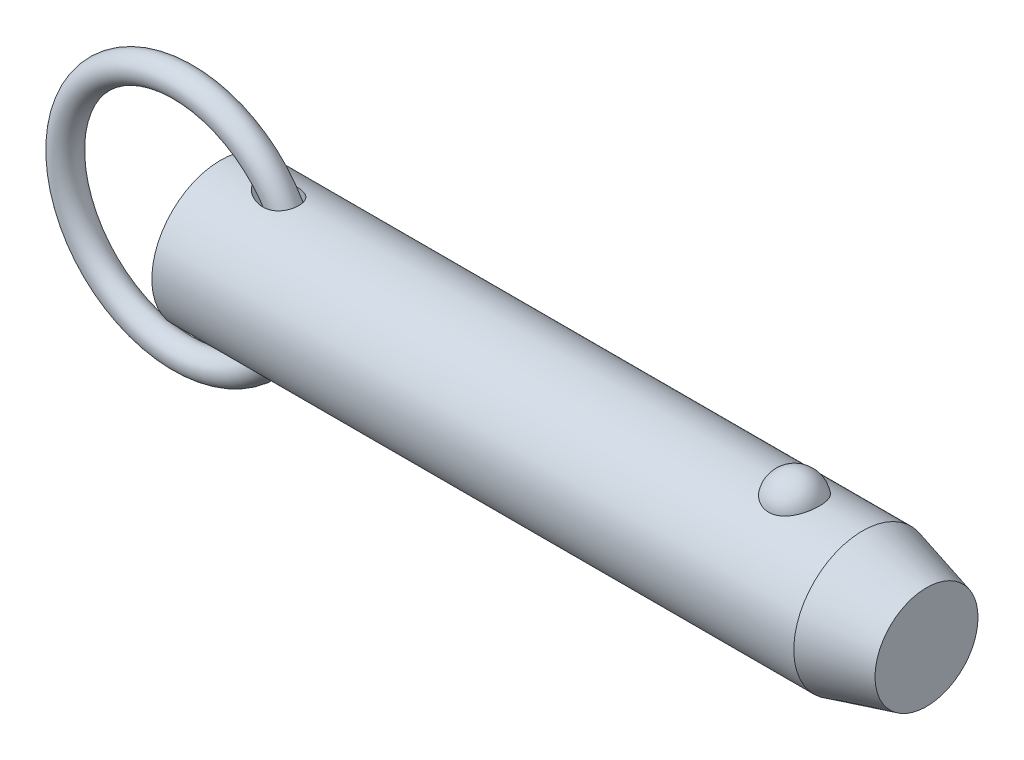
ISO-10303-21;
HEADER;
FILE_DESCRIPTION(('STEP AP214'),'2;1');
FILE_NAME('part.step','',(''),(''),'','','');
FILE_SCHEMA(('AUTOMOTIVE_DESIGN { 1 0 10303 214 1 1 1 1 }'));
ENDSEC;
DATA;
#1=APPLICATION_CONTEXT('core data for automotive mechanical design processes');
#2=APPLICATION_PROTOCOL_DEFINITION('international standard','automotive_design',2000,#1);
#3=PRODUCT_CONTEXT('',#1,'mechanical');
#4=PRODUCT('Part','Part','',(#3));
#5=PRODUCT_RELATED_PRODUCT_CATEGORY('part','',(#4));
#6=PRODUCT_DEFINITION_FORMATION('','',#4);
#7=PRODUCT_DEFINITION_CONTEXT('part definition',#1,'design');
#8=PRODUCT_DEFINITION('design','',#6,#7);
#9=PRODUCT_DEFINITION_SHAPE('','',#8);
#10=(LENGTH_UNIT() NAMED_UNIT(*) SI_UNIT(.MILLI.,.METRE.));
#11=(NAMED_UNIT(*) PLANE_ANGLE_UNIT() SI_UNIT($,.RADIAN.));
#12=(NAMED_UNIT(*) SI_UNIT($,.STERADIAN.) SOLID_ANGLE_UNIT());
#13=UNCERTAINTY_MEASURE_WITH_UNIT(LENGTH_MEASURE(1.E-05),#10,'distance_accuracy_value','');
#14=(GEOMETRIC_REPRESENTATION_CONTEXT(3) GLOBAL_UNCERTAINTY_ASSIGNED_CONTEXT((#13)) GLOBAL_UNIT_ASSIGNED_CONTEXT((#10,
#11,#12)) REPRESENTATION_CONTEXT('',''));
#15=CARTESIAN_POINT('',(0.,0.,0.));
#16=DIRECTION('',(0.,0.,1.));
#17=DIRECTION('',(1.,0.,0.));
#18=AXIS2_PLACEMENT_3D('',#15,#16,#17);
#19=CARTESIAN_POINT('',(-6.08699288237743,0.,0.));
#20=DIRECTION('',(0.,0.,1.));
#21=DIRECTION('',(1.,0.,0.));
#22=AXIS2_PLACEMENT_3D('',#19,#20,#21);
#23=TOROIDAL_SURFACE('',#22,19.05,2.223);
#24=CARTESIAN_POINT('',(15.1860071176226,0.,0.));
#25=VERTEX_POINT('',#24);
#26=VERTEX_LOOP('',#25);
#27=FACE_BOUND('',#26,.T.);
#28=ADVANCED_FACE('P0_F12',(#27),#23,.T.);
#29=CLOSED_SHELL('',(#28));
#30=MANIFOLD_SOLID_BREP('P0_B1',#29);
#31=CARTESIAN_POINT('',(0.,0.,0.));
#32=DIRECTION('',(1.,0.,0.));
#33=DIRECTION('',(0.,0.,-1.));
#34=AXIS2_PLACEMENT_3D('',#31,#32,#33);
#35=CYLINDRICAL_SURFACE('',#34,11.115);
#36=CARTESIAN_POINT('',(6.41405181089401,11.0227946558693,-1.4287136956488));
#37=CARTESIAN_POINT('',(6.49338916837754,11.0115377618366,-1.51556642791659));
#38=CARTESIAN_POINT('',(6.57765461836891,10.9998263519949,-1.59789397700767));
#39=CARTESIAN_POINT('',(6.75386647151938,10.9760304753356,-1.75391400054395));
#40=CARTESIAN_POINT('',(6.84582247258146,10.9639455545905,-1.82759540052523));
#41=CARTESIAN_POINT('',(7.03627827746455,10.9397989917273,-1.96698954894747));
#42=CARTESIAN_POINT('',(7.13480838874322,10.9277377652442,-2.03266078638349));
#43=CARTESIAN_POINT('',(7.33681032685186,10.9041015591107,-2.1558582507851));
#44=CARTESIAN_POINT('',(7.44028007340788,10.8925263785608,-2.21338786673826));
#45=CARTESIAN_POINT('',(7.64386117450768,10.8710104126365,-2.31666528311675));
#46=CARTESIAN_POINT('',(7.74368989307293,10.8610119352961,-2.36295942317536));
#47=CARTESIAN_POINT('',(7.94637195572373,10.8420168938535,-2.44863486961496));
#48=CARTESIAN_POINT('',(8.04922612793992,10.8330206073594,-2.48801426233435));
#49=CARTESIAN_POINT('',(8.36115573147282,10.807980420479,-2.59542730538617));
#50=CARTESIAN_POINT('',(8.57411849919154,10.7938278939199,-2.65299817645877));
#51=CARTESIAN_POINT('',(9.00825016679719,10.7725818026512,-2.73800108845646));
#52=CARTESIAN_POINT('',(9.22947335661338,10.7655491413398,-2.76517330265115));
#53=CARTESIAN_POINT('',(9.67368141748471,10.7605872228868,-2.78445308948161));
#54=CARTESIAN_POINT('',(9.89666486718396,10.7626512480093,-2.77658653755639));
#55=CARTESIAN_POINT('',(10.2950172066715,10.7754452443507,-2.72644436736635));
#56=CARTESIAN_POINT('',(10.4712789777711,10.7844280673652,-2.69109376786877));
#57=CARTESIAN_POINT('',(10.7292776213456,10.8024982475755,-2.61722365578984));
#58=CARTESIAN_POINT('',(10.8142337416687,10.8092901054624,-2.58911576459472));
#59=CARTESIAN_POINT('',(10.9813218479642,10.8242580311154,-2.52581287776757));
#60=CARTESIAN_POINT('',(11.0634550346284,10.8324335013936,-2.49062094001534));
#61=CARTESIAN_POINT('',(11.2247418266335,10.8500287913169,-2.41281958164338));
#62=CARTESIAN_POINT('',(11.3038694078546,10.8594572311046,-2.37015806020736));
#63=CARTESIAN_POINT('',(11.4576781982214,10.8792243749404,-2.27770403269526));
#64=CARTESIAN_POINT('',(11.5323615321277,10.8895626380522,-2.22791497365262));
#65=CARTESIAN_POINT('',(11.6765388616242,10.9108113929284,-2.12140590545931));
#66=CARTESIAN_POINT('',(11.7460329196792,10.9217218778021,-2.06468597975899));
#67=CARTESIAN_POINT('',(11.8790597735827,10.9437207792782,-1.94471764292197));
#68=CARTESIAN_POINT('',(11.9425932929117,10.9548091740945,-1.88147002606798));
#69=CARTESIAN_POINT('',(12.109388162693,10.9851999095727,-1.69784918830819));
#70=CARTESIAN_POINT('',(12.205655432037,11.0042655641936,-1.57093023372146));
#71=CARTESIAN_POINT('',(12.374151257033,11.0393391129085,-1.3017676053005));
#72=CARTESIAN_POINT('',(12.4463875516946,11.0553479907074,-1.15952888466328));
#73=CARTESIAN_POINT('',(12.5615818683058,11.0816338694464,-0.871972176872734));
#74=CARTESIAN_POINT('',(12.6058896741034,11.0921698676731,-0.727217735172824));
#75=CARTESIAN_POINT('',(12.6699315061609,11.1075802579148,-0.432089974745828));
#76=CARTESIAN_POINT('',(12.6896681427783,11.1124552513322,-0.281717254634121));
#77=CARTESIAN_POINT('',(12.7040225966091,11.1159901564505,0.0188164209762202));
#78=CARTESIAN_POINT('',(12.6988836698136,11.1147102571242,0.168965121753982));
#79=CARTESIAN_POINT('',(12.6641681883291,11.1062126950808,0.466238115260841));
#80=CARTESIAN_POINT('',(12.6345920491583,11.0989951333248,0.61336245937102));
#81=CARTESIAN_POINT('',(12.5517453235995,11.0794095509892,0.900330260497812));
#82=CARTESIAN_POINT('',(12.4984878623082,11.0670443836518,1.0401777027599));
#83=CARTESIAN_POINT('',(12.3696588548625,11.0385082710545,1.308745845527));
#84=CARTESIAN_POINT('',(12.2940887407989,11.0223375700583,1.43746725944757));
#85=CARTESIAN_POINT('',(12.122380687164,10.987872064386,1.68079704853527));
#86=CARTESIAN_POINT('',(12.0261637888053,10.969569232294,1.79534850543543));
#87=CARTESIAN_POINT('',(11.8161707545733,10.932836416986,2.00695695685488));
#88=CARTESIAN_POINT('',(11.7023941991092,10.9144064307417,2.10401353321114));
#89=CARTESIAN_POINT('',(11.4575656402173,10.8788057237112,2.28105326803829));
#90=CARTESIAN_POINT('',(11.3261451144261,10.8616794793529,2.36053412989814));
#91=CARTESIAN_POINT('',(11.0523589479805,10.8308019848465,2.49839044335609));
#92=CARTESIAN_POINT('',(10.9099908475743,10.8170514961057,2.55676113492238));
#93=CARTESIAN_POINT('',(10.6060622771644,10.7929728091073,2.65666105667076));
#94=CARTESIAN_POINT('',(10.4438877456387,10.7830209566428,2.69640163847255));
#95=CARTESIAN_POINT('',(10.1154037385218,10.7687230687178,2.75293129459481));
#96=CARTESIAN_POINT('',(9.94909141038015,10.7643810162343,2.76970406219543));
#97=CARTESIAN_POINT('',(9.54387061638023,10.7604809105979,2.7848723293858));
#98=CARTESIAN_POINT('',(9.30446860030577,10.7637793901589,2.77227753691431));
#99=CARTESIAN_POINT('',(8.9496125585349,10.7757341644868,2.72524141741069));
#100=CARTESIAN_POINT('',(8.83186896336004,10.7808994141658,2.70482239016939));
#101=CARTESIAN_POINT('',(8.59835142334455,10.7932548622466,2.6550999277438));
#102=CARTESIAN_POINT('',(8.48257728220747,10.8004448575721,2.62579738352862));
#103=CARTESIAN_POINT('',(8.25208469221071,10.8166382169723,2.55827624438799));
#104=CARTESIAN_POINT('',(8.13740214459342,10.8256649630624,2.51994155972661));
#105=CARTESIAN_POINT('',(7.91132058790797,10.8451170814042,2.43486475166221));
#106=CARTESIAN_POINT('',(7.79992154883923,10.8555424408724,2.38812270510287));
#107=CARTESIAN_POINT('',(7.58115677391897,10.8774251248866,2.28638483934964));
#108=CARTESIAN_POINT('',(7.47378802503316,10.8888816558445,2.23139534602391));
#109=CARTESIAN_POINT('',(7.26385624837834,10.9124540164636,2.1131026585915));
#110=CARTESIAN_POINT('',(7.16129168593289,10.9245696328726,2.04980214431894));
#111=CARTESIAN_POINT('',(6.91882218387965,10.9543689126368,1.88540538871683));
#112=CARTESIAN_POINT('',(6.78193778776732,10.9721958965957,1.77979827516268));
#113=CARTESIAN_POINT('',(6.5247244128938,11.0070222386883,1.54989693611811));
#114=CARTESIAN_POINT('',(6.40436902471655,11.0240228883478,1.42563320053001));
#115=CARTESIAN_POINT('',(6.21838804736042,11.0509658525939,1.19529359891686));
#116=CARTESIAN_POINT('',(6.14691885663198,11.0615430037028,1.09404520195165));
#117=CARTESIAN_POINT('',(6.02043496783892,11.0805004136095,0.881508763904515));
#118=CARTESIAN_POINT('',(5.96539400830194,11.0888841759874,0.770237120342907));
#119=CARTESIAN_POINT('',(5.88475453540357,11.1012553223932,0.560577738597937));
#120=CARTESIAN_POINT('',(5.85559643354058,11.1057686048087,0.463603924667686));
#121=CARTESIAN_POINT('',(5.81381299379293,11.1122523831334,0.266083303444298));
#122=CARTESIAN_POINT('',(5.80117118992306,11.1142254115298,0.165540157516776));
#123=CARTESIAN_POINT('',(5.79363815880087,11.1153999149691,-0.036474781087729));
#124=CARTESIAN_POINT('',(5.79878799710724,11.1145949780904,-0.137948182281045));
#125=CARTESIAN_POINT('',(5.82639592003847,11.1102987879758,-0.338493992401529));
#126=CARTESIAN_POINT('',(5.84887234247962,11.1068046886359,-0.43756374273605));
#127=CARTESIAN_POINT('',(5.91510741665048,11.0965857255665,-0.649968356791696));
#128=CARTESIAN_POINT('',(5.9622090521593,11.0893566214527,-0.762222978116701));
#129=CARTESIAN_POINT('',(6.07378449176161,11.072471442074,-0.977396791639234));
#130=CARTESIAN_POINT('',(6.13826787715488,11.0628140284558,-1.08031079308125));
#131=CARTESIAN_POINT('',(6.2410107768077,11.0477136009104,-1.2219580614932));
#132=CARTESIAN_POINT('',(6.27403486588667,11.042895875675,-1.26469183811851));
#133=CARTESIAN_POINT('',(6.34238022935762,11.0330152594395,-1.34817011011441));
#134=CARTESIAN_POINT('',(6.37769867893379,11.0279526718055,-1.38891694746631));
#135=CARTESIAN_POINT('',(6.41405181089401,11.0227946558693,-1.4287136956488));
#136=B_SPLINE_CURVE_WITH_KNOTS('',3,(#36,#37,#38,#39,#40,#41,#42,#43,#44,#45,#46,#47,#48,#49,
#50,#51,#52,#53,#54,#55,#56,#57,#58,#59,#60,#61,#62,#63,#64,#65,#66,#67,#68,#69,#70,#71,#72,#73,
#74,#75,#76,#77,#78,#79,#80,#81,#82,#83,#84,#85,#86,#87,#88,#89,#90,#91,#92,#93,#94,#95,#96,#97,
#98,#99,#100,#101,#102,#103,#104,#105,#106,#107,#108,#109,#110,#111,#112,#113,#114,#115,#116,
#117,#118,#119,#120,#121,#122,#123,#124,#125,#126,#127,#128,#129,#130,#131,#132,#133,#134,#135),
.UNSPECIFIED.,.T.,.F.,(4,2,2,2,2,2,2,2,2,2,2,2,2,2,2,2,2,2,2,2,2,2,2,2,2,2,2,2,2,2,2,2,2,2,2,2,
2,2,2,2,2,2,2,2,2,2,2,2,2,4),(0.,0.35443329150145,0.709315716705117,1.0659654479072,
1.42246628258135,1.7536715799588,2.08496839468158,2.74582009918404,3.41227815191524,
4.07824412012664,4.61583787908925,4.88478112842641,5.1536085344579,5.42439170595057,
5.69504436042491,5.96569375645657,6.23631025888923,6.71490729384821,7.19335005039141,
7.64641437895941,8.09943057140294,8.54802575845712,8.99661331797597,9.44495256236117,
9.89326303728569,10.3433195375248,10.7933867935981,11.2550086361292,11.7167345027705,
12.2165866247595,12.7167934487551,13.4318876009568,13.7904664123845,14.1490092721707,
14.5124394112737,14.8758662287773,15.239015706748,15.6020483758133,16.1219860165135,
16.6410830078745,17.0130520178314,17.3844231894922,17.6872330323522,17.9897407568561,
18.2929471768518,18.5964749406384,18.9603532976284,19.3244326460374,19.4870338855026,
19.649438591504),.UNSPECIFIED.);
#137=CARTESIAN_POINT('',(6.41405181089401,11.0227946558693,-1.4287136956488));
#138=VERTEX_POINT('',#137);
#139=EDGE_CURVE('P1_E40',#138,#138,#136,.T.);
#140=ORIENTED_EDGE('',*,*,#139,.T.);
#141=EDGE_LOOP('',(#140));
#142=FACE_BOUND('',#141,.T.);
#143=CARTESIAN_POINT('',(103.929563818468,0.,0.));
#144=DIRECTION('',(1.,0.,0.));
#145=DIRECTION('',(0.,0.,-1.));
#146=AXIS2_PLACEMENT_3D('',#143,#144,#145);
#147=CIRCLE('',#146,11.115);
#148=CARTESIAN_POINT('',(103.929563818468,0.,-11.115));
#149=VERTEX_POINT('',#148);
#150=EDGE_CURVE('P1_E25',#149,#149,#147,.T.);
#151=ORIENTED_EDGE('',*,*,#150,.F.);
#152=EDGE_LOOP('',(#151));
#153=FACE_BOUND('',#152,.T.);
#154=CARTESIAN_POINT('',(0.,0.,0.));
#155=DIRECTION('',(1.,0.,0.));
#156=DIRECTION('',(0.,0.,-1.));
#157=AXIS2_PLACEMENT_3D('',#154,#155,#156);
#158=CIRCLE('',#157,11.115);
#159=CARTESIAN_POINT('',(0.,0.,-11.115));
#160=VERTEX_POINT('',#159);
#161=EDGE_CURVE('P1_E9',#160,#160,#158,.T.);
#162=ORIENTED_EDGE('',*,*,#161,.T.);
#163=EDGE_LOOP('',(#162));
#164=FACE_BOUND('',#163,.T.);
#165=CARTESIAN_POINT('',(92.9310680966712,10.3028087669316,4.17077409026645));
#166=CARTESIAN_POINT('',(92.7147756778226,10.3028003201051,4.17078240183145));
#167=CARTESIAN_POINT('',(92.4985488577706,10.3098895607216,4.15340593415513));
#168=CARTESIAN_POINT('',(92.0725408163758,10.3373834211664,4.08449540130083));
#169=CARTESIAN_POINT('',(91.8627577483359,10.3577841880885,4.0329712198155));
#170=CARTESIAN_POINT('',(91.4557825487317,10.4095237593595,3.89746513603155));
#171=CARTESIAN_POINT('',(91.2585726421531,10.4408466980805,3.81353029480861));
#172=CARTESIAN_POINT('',(90.8813382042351,10.5110236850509,3.61560339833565));
#173=CARTESIAN_POINT('',(90.7013171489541,10.5498792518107,3.50160528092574));
#174=CARTESIAN_POINT('',(90.3576842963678,10.6322884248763,3.24292464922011));
#175=CARTESIAN_POINT('',(90.1946861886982,10.6759443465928,3.09746040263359));
#176=CARTESIAN_POINT('',(89.8945911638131,10.7625291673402,2.78171925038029));
#177=CARTESIAN_POINT('',(89.7574990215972,10.8054579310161,2.61143778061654));
#178=CARTESIAN_POINT('',(89.5064084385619,10.8881935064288,2.24226695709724));
#179=CARTESIAN_POINT('',(89.3937105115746,10.9277761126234,2.04244123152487));
#180=CARTESIAN_POINT('',(89.2017771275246,10.997484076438,1.62578254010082));
#181=CARTESIAN_POINT('',(89.1225446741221,11.0276085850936,1.40894804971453));
#182=CARTESIAN_POINT('',(88.9983034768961,11.0756732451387,0.961250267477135));
#183=CARTESIAN_POINT('',(88.953760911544,11.0934470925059,0.730239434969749));
#184=CARTESIAN_POINT('',(88.9015695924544,11.1143331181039,0.263439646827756));
#185=CARTESIAN_POINT('',(88.8939200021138,11.1174456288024,0.0276507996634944));
#186=CARTESIAN_POINT('',(88.9156105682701,11.1087161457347,-0.440729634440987));
#187=CARTESIAN_POINT('',(88.9447624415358,11.0969502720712,-0.673331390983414));
#188=CARTESIAN_POINT('',(89.0391432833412,11.0597872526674,-1.12996621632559));
#189=CARTESIAN_POINT('',(89.1043729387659,11.0343898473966,-1.35399912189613));
#190=CARTESIAN_POINT('',(89.2696984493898,10.972515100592,-1.78750286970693));
#191=CARTESIAN_POINT('',(89.3698386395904,10.9360236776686,-1.99695478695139));
#192=CARTESIAN_POINT('',(89.6029408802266,10.8557595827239,-2.3952066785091));
#193=CARTESIAN_POINT('',(89.7359054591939,10.8119863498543,-2.5840050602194));
#194=CARTESIAN_POINT('',(90.032407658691,10.7216733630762,-2.93635726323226));
#195=CARTESIAN_POINT('',(90.1960565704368,10.675123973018,-3.09981510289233));
#196=CARTESIAN_POINT('',(90.5498601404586,10.5846571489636,-3.39592247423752));
#197=CARTESIAN_POINT('',(90.7400123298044,10.5407394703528,-3.52857487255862));
#198=CARTESIAN_POINT('',(91.1375014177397,10.4616690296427,-3.75646057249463));
#199=CARTESIAN_POINT('',(91.3443670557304,10.4263443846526,-3.85245432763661));
#200=CARTESIAN_POINT('',(91.7729541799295,10.3675574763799,-4.00798747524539));
#201=CARTESIAN_POINT('',(91.994670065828,10.344090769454,-4.0675405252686));
#202=CARTESIAN_POINT('',(92.4346695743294,10.3128282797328,-4.14614314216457));
#203=CARTESIAN_POINT('',(92.6525654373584,10.3043040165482,-4.1670783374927));
#204=CARTESIAN_POINT('',(93.08894951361,10.3016771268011,-4.17357158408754));
#205=CARTESIAN_POINT('',(93.3074376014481,10.3075716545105,-4.15913661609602));
#206=CARTESIAN_POINT('',(93.7317442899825,10.3326686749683,-4.09636961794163));
#207=CARTESIAN_POINT('',(93.9377458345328,10.3514555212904,-4.0490957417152));
#208=CARTESIAN_POINT('',(94.3385764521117,10.399818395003,-3.92320197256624));
#209=CARTESIAN_POINT('',(94.5334046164,10.4293952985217,-3.84457953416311));
#210=CARTESIAN_POINT('',(94.9111917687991,10.4969600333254,-3.65612410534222));
#211=CARTESIAN_POINT('',(95.0937974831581,10.5351178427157,-3.54564545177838));
#212=CARTESIAN_POINT('',(95.4382040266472,10.6154999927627,-3.29718036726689));
#213=CARTESIAN_POINT('',(95.600000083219,10.657725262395,-3.15918764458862));
#214=CARTESIAN_POINT('',(95.9069596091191,10.744212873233,-2.85163580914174));
#215=CARTESIAN_POINT('',(96.0508919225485,10.7884718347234,-2.68084605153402));
#216=CARTESIAN_POINT('',(96.3092371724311,10.872374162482,-2.3172186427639));
#217=CARTESIAN_POINT('',(96.4236448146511,10.9120167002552,-2.12437704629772));
#218=CARTESIAN_POINT('',(96.6238739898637,10.9838919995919,-1.71516999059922));
#219=CARTESIAN_POINT('',(96.7086617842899,11.0158465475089,-1.498248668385));
#220=CARTESIAN_POINT('',(96.8426838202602,11.0673523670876,-1.05228572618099));
#221=CARTESIAN_POINT('',(96.8919174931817,11.086903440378,-0.823243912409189));
#222=CARTESIAN_POINT('',(96.9538915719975,11.1116323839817,-0.359087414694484));
#223=CARTESIAN_POINT('',(96.9665662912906,11.1167843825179,-0.123962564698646));
#224=CARTESIAN_POINT('',(96.954973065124,11.1121144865,0.345220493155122));
#225=CARTESIAN_POINT('',(96.9307056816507,11.1022928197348,0.579278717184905));
#226=CARTESIAN_POINT('',(96.8459073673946,11.0687504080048,1.03866534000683));
#227=CARTESIAN_POINT('',(96.7855299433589,11.0450885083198,1.26402641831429));
#228=CARTESIAN_POINT('',(96.6298532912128,10.9863185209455,1.70076772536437));
#229=CARTESIAN_POINT('',(96.534551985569,10.9512097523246,1.91214712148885));
#230=CARTESIAN_POINT('',(96.3103974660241,10.8729733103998,2.31608359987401));
#231=CARTESIAN_POINT('',(96.1813806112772,10.8298068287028,2.50854240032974));
#232=CARTESIAN_POINT('',(95.8927327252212,10.7401896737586,2.86808766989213));
#233=CARTESIAN_POINT('',(95.7331022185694,10.6937390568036,3.03517457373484));
#234=CARTESIAN_POINT('',(95.3875341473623,10.6029321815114,3.33857581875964));
#235=CARTESIAN_POINT('',(95.2017089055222,10.5585680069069,3.47501541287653));
#236=CARTESIAN_POINT('',(94.8078750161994,10.4769321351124,3.71390897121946));
#237=CARTESIAN_POINT('',(94.5998635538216,10.439661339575,3.81635861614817));
#238=CARTESIAN_POINT('',(94.1540666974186,10.3749407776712,3.98910631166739));
#239=CARTESIAN_POINT('',(93.9152342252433,10.3482457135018,4.05700929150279));
#240=CARTESIAN_POINT('',(93.4279254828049,10.312188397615,4.14782844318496));
#241=CARTESIAN_POINT('',(93.1794535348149,10.3028184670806,4.17076454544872));
#242=CARTESIAN_POINT('',(92.9310680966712,10.3028087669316,4.17077409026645));
#243=B_SPLINE_CURVE_WITH_KNOTS('',3,(#165,#166,#167,#168,#169,#170,#171,#172,#173,#174,#175,
#176,#177,#178,#179,#180,#181,#182,#183,#184,#185,#186,#187,#188,#189,#190,#191,#192,#193,#194,
#195,#196,#197,#198,#199,#200,#201,#202,#203,#204,#205,#206,#207,#208,#209,#210,#211,#212,#213,
#214,#215,#216,#217,#218,#219,#220,#221,#222,#223,#224,#225,#226,#227,#228,#229,#230,#231,#232,
#233,#234,#235,#236,#237,#238,#239,#240,#241,#242),.UNSPECIFIED.,.T.,.F.,(4,2,2,2,2,2,2,2,2,2,2,
2,2,2,2,2,2,2,2,2,2,2,2,2,2,2,2,2,2,2,2,2,2,2,2,2,2,2,4),(0.,0.647966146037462,1.29574482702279,
1.94258643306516,2.58955857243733,3.25496465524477,3.92049326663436,4.61566368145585,
5.3108964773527,6.01531821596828,6.71972398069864,7.42054043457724,8.12137023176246,
8.82309331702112,9.52487047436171,10.2292439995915,10.9335519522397,11.6223330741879,
12.3108558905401,12.9647664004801,13.6185478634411,14.2521847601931,14.8858731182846,
15.5334360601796,16.1811472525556,16.8611459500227,17.5412664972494,18.2431855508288,
18.9451158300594,19.6483065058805,20.3514864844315,21.0516982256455,21.7519516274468,
22.4556690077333,23.1593743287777,23.8601491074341,24.5610129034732,25.3054529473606,
26.049562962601),.UNSPECIFIED.);
#244=CARTESIAN_POINT('',(92.9310680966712,10.3028087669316,4.17077409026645));
#245=VERTEX_POINT('',#244);
#246=EDGE_CURVE('P1_E34',#245,#245,#243,.T.);
#247=ORIENTED_EDGE('',*,*,#246,.T.);
#248=EDGE_LOOP('',(#247));
#249=FACE_BOUND('',#248,.T.);
#250=CARTESIAN_POINT('',(6.41405181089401,-11.0227946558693,-1.4287136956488));
#251=CARTESIAN_POINT('',(6.33124061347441,-11.0345445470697,-1.33806125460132));
#252=CARTESIAN_POINT('',(6.25372866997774,-11.0458090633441,-1.24240732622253));
#253=CARTESIAN_POINT('',(6.11277905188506,-11.0666115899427,-1.04095704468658));
#254=CARTESIAN_POINT('',(6.0493392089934,-11.0761498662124,-0.935162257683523));
#255=CARTESIAN_POINT('',(5.94029181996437,-11.0927063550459,-0.712476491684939));
#256=CARTESIAN_POINT('',(5.89492964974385,-11.0996897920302,-0.595457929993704));
#257=CARTESIAN_POINT('',(5.8449816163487,-11.1074141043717,-0.414997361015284));
#258=CARTESIAN_POINT('',(5.83135004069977,-11.1095300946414,-0.354047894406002));
#259=CARTESIAN_POINT('',(5.81051649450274,-11.1127688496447,-0.231041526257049));
#260=CARTESIAN_POINT('',(5.80331311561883,-11.1138918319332,-0.1689848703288));
#261=CARTESIAN_POINT('',(5.79296529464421,-11.1155042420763,-0.000484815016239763));
#262=CARTESIAN_POINT('',(5.79625267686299,-11.1149904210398,0.106437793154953));
#263=CARTESIAN_POINT('',(5.82213676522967,-11.1109609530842,0.317809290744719));
#264=CARTESIAN_POINT('',(5.84474662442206,-11.1074432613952,0.422256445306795));
#265=CARTESIAN_POINT('',(5.91113114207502,-11.097197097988,0.63936180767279));
#266=CARTESIAN_POINT('',(5.95733120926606,-11.090102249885,0.751250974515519));
#267=CARTESIAN_POINT('',(6.06709542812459,-11.0734770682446,0.965912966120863));
#268=CARTESIAN_POINT('',(6.13068735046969,-11.06394284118,1.06867085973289));
#269=CARTESIAN_POINT('',(6.30294237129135,-11.0385920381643,1.30890635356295));
#270=CARTESIAN_POINT('',(6.4189620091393,-11.0218881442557,1.44097376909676));
#271=CARTESIAN_POINT('',(6.66989654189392,-10.9871512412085,1.68553954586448));
#272=CARTESIAN_POINT('',(6.80485520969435,-10.9691152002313,1.79799117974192));
#273=CARTESIAN_POINT('',(7.04881236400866,-10.9382283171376,1.97587596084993));
#274=CARTESIAN_POINT('',(7.15465712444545,-10.9253240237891,2.04570822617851));
#275=CARTESIAN_POINT('',(7.37202504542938,-10.9000987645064,2.17611840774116));
#276=CARTESIAN_POINT('',(7.48355057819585,-10.8877780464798,2.23669241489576));
#277=CARTESIAN_POINT('',(7.71132418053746,-10.8641580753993,2.34873831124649));
#278=CARTESIAN_POINT('',(7.82757727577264,-10.8528599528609,2.40020018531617));
#279=CARTESIAN_POINT('',(8.06386825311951,-10.8317234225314,2.49385169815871));
#280=CARTESIAN_POINT('',(8.18390558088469,-10.8218848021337,2.53604268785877));
#281=CARTESIAN_POINT('',(8.42918336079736,-10.8039208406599,2.61152283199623));
#282=CARTESIAN_POINT('',(8.55447802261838,-10.7958283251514,2.64464414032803));
#283=CARTESIAN_POINT('',(8.80752127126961,-10.781995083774,2.70048793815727));
#284=CARTESIAN_POINT('',(8.9352701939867,-10.7762546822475,2.72320899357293));
#285=CARTESIAN_POINT('',(9.19210176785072,-10.7675291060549,2.75750994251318));
#286=CARTESIAN_POINT('',(9.32118105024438,-10.7645381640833,2.76911315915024));
#287=CARTESIAN_POINT('',(9.57984338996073,-10.761622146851,2.78042035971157));
#288=CARTESIAN_POINT('',(9.70942621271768,-10.7616957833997,2.78012934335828));
#289=CARTESIAN_POINT('',(10.0243125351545,-10.7659059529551,2.76381534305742));
#290=CARTESIAN_POINT('',(10.209307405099,-10.7717977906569,2.74099674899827));
#291=CARTESIAN_POINT('',(10.5731188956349,-10.7905408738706,2.66626238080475));
#292=CARTESIAN_POINT('',(10.7519389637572,-10.8033881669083,2.61436313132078));
#293=CARTESIAN_POINT('',(11.0114289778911,-10.8271584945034,2.51336808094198));
#294=CARTESIAN_POINT('',(11.0968318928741,-10.835881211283,2.47562331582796));
#295=CARTESIAN_POINT('',(11.2636000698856,-10.8545688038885,2.39236170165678));
#296=CARTESIAN_POINT('',(11.344967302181,-10.8645330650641,2.3468486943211));
#297=CARTESIAN_POINT('',(11.5027832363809,-10.8853818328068,2.24815967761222));
#298=CARTESIAN_POINT('',(11.5792327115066,-10.8962661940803,2.19498487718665));
#299=CARTESIAN_POINT('',(11.7263315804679,-10.9185541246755,2.08128855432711));
#300=CARTESIAN_POINT('',(11.7969818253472,-10.9299576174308,2.02076811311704));
#301=CARTESIAN_POINT('',(11.9817953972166,-10.9613645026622,1.84513663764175));
#302=CARTESIAN_POINT('',(12.0893012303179,-10.9814643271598,1.72286660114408));
#303=CARTESIAN_POINT('',(12.2803576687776,-11.0193991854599,1.46066991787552));
#304=CARTESIAN_POINT('',(12.3639173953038,-11.0372350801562,1.32075002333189));
#305=CARTESIAN_POINT('',(12.4996220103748,-11.0672969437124,1.03778067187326));
#306=CARTESIAN_POINT('',(12.5535315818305,-11.0798242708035,0.895607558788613));
#307=CARTESIAN_POINT('',(12.636874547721,-11.0995427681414,0.603918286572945));
#308=CARTESIAN_POINT('',(12.6663115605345,-11.1067347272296,0.454403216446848));
#309=CARTESIAN_POINT('',(12.6997387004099,-11.1149224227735,0.154577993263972));
#310=CARTESIAN_POINT('',(12.7040886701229,-11.1160057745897,0.00431019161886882));
#311=CARTESIAN_POINT('',(12.6882048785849,-11.1120956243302,-0.294841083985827));
#312=CARTESIAN_POINT('',(12.6679715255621,-11.1071022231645,-0.44372458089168));
#313=CARTESIAN_POINT('',(12.6034470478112,-11.0915888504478,-0.735688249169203));
#314=CARTESIAN_POINT('',(12.5591858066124,-11.0810757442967,-0.878775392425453));
#315=CARTESIAN_POINT('',(12.4477416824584,-11.0556687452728,-1.15529525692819));
#316=CARTESIAN_POINT('',(12.3805601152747,-11.0407751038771,-1.2887285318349));
#317=CARTESIAN_POINT('',(12.2248919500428,-11.0081839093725,-1.54257976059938));
#318=CARTESIAN_POINT('',(12.1363549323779,-10.9904797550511,-1.66296592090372));
#319=CARTESIAN_POINT('',(11.9406137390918,-10.9541951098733,-1.88726577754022));
#320=CARTESIAN_POINT('',(11.833409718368,-10.9356146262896,-1.99117961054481));
#321=CARTESIAN_POINT('',(11.601318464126,-10.8991360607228,-2.18213646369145));
#322=CARTESIAN_POINT('',(11.4761325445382,-10.8812577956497,-2.26881927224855));
#323=CARTESIAN_POINT('',(11.2134852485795,-10.8482871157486,-2.42157282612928));
#324=CARTESIAN_POINT('',(11.0760218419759,-10.8331951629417,-2.48764015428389));
#325=CARTESIAN_POINT('',(10.7828968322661,-10.8061050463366,-2.60290068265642));
#326=CARTESIAN_POINT('',(10.6266338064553,-10.7943907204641,-2.65062248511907));
#327=CARTESIAN_POINT('',(10.3086617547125,-10.7762429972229,-2.72345054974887));
#328=CARTESIAN_POINT('',(10.146948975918,-10.7698133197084,-2.74854088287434));
#329=CARTESIAN_POINT('',(9.75541304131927,-10.7608036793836,-2.78368719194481));
#330=CARTESIAN_POINT('',(9.52459435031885,-10.7608467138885,-2.78350276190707));
#331=CARTESIAN_POINT('',(9.06604960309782,-10.7702674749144,-2.74677945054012));
#332=CARTESIAN_POINT('',(8.83832966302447,-10.7796615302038,-2.71017697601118));
#333=CARTESIAN_POINT('',(8.38783466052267,-10.8058248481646,-2.60392490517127));
#334=CARTESIAN_POINT('',(8.16517101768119,-10.8226939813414,-2.53382676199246));
#335=CARTESIAN_POINT('',(7.84087311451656,-10.8516548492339,-2.40555545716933));
#336=CARTESIAN_POINT('',(7.73435551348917,-10.8619221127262,-2.35892455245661));
#337=CARTESIAN_POINT('',(7.52510420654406,-10.883357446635,-2.25797017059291));
#338=CARTESIAN_POINT('',(7.4223698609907,-10.8945253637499,-2.20364800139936));
#339=CARTESIAN_POINT('',(7.23808758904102,-10.915528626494,-2.09688018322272));
#340=CARTESIAN_POINT('',(7.15584631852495,-10.9252787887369,-2.0456107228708));
#341=CARTESIAN_POINT('',(6.99510576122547,-10.944960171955,-1.93754729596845));
#342=CARTESIAN_POINT('',(6.91660574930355,-10.9548913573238,-1.88075440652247));
#343=CARTESIAN_POINT('',(6.76418133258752,-10.974690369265,-1.76154504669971));
#344=CARTESIAN_POINT('',(6.69024940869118,-10.9845582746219,-1.6991382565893));
#345=CARTESIAN_POINT('',(6.54780119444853,-11.0039826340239,-1.56842485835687));
#346=CARTESIAN_POINT('',(6.47928247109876,-11.0135392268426,-1.50012092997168));
#347=CARTESIAN_POINT('',(6.41405181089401,-11.0227946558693,-1.4287136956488));
#348=B_SPLINE_CURVE_WITH_KNOTS('',3,(#250,#251,#252,#253,#254,#255,#256,#257,#258,#259,#260,
#261,#262,#263,#264,#265,#266,#267,#268,#269,#270,#271,#272,#273,#274,#275,#276,#277,#278,#279,
#280,#281,#282,#283,#284,#285,#286,#287,#288,#289,#290,#291,#292,#293,#294,#295,#296,#297,#298,
#299,#300,#301,#302,#303,#304,#305,#306,#307,#308,#309,#310,#311,#312,#313,#314,#315,#316,#317,
#318,#319,#320,#321,#322,#323,#324,#325,#326,#327,#328,#329,#330,#331,#332,#333,#334,#335,#336,
#337,#338,#339,#340,#341,#342,#343,#344,#345,#346,#347),.UNSPECIFIED.,.T.,.F.,(4,2,2,2,2,2,2,2,
2,2,2,2,2,2,2,2,2,2,2,2,2,2,2,2,2,2,2,2,2,2,2,2,2,2,2,2,2,2,2,2,2,2,2,2,2,2,2,2,4),(0.,
0.36983565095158,0.739614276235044,1.1142538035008,1.30141910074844,1.48854338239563,
1.8074587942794,2.12659146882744,2.4883888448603,2.85076733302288,3.3776216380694,
3.90571433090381,4.287639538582,4.66972556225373,5.05222896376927,5.43467659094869,
5.82378546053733,6.21294796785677,6.6012922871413,6.98947336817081,7.54669558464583,
8.10360148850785,8.3845853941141,8.66543074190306,8.94623182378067,9.22699162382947,
9.7162888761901,10.2053995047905,10.6608871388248,11.1163074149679,11.5651786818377,
12.0140424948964,12.4623493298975,12.9106304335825,13.3599804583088,13.8093267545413,
14.2672570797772,14.7252632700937,15.214740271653,15.7045615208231,16.3932594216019,
17.083162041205,17.7825738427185,18.1325177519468,18.4824022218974,18.7744056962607,
19.0663523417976,19.3578048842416,19.6491256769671),.UNSPECIFIED.);
#349=CARTESIAN_POINT('',(6.41405181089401,-11.0227946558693,-1.4287136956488));
#350=VERTEX_POINT('',#349);
#351=EDGE_CURVE('P1_E17',#350,#350,#348,.T.);
#352=ORIENTED_EDGE('',*,*,#351,.T.);
#353=EDGE_LOOP('',(#352));
#354=FACE_BOUND('',#353,.T.);
#355=ADVANCED_FACE('P1_F13',(#142,#153,#164,#249,#354),#35,.T.);
#356=CARTESIAN_POINT('',(0.,0.,0.));
#357=DIRECTION('',(-1.,0.,0.));
#358=DIRECTION('',(0.,0.,1.));
#359=AXIS2_PLACEMENT_3D('',#356,#357,#358);
#360=PLANE('',#359);
#361=ORIENTED_EDGE('',*,*,#161,.F.);
#362=EDGE_LOOP('',(#361));
#363=FACE_BOUND('',#362,.T.);
#364=ADVANCED_FACE('P1_F15',(#363),#360,.T.);
#365=CARTESIAN_POINT('',(114.3,0.,0.));
#366=DIRECTION('',(-1.,0.,0.));
#367=DIRECTION('',(0.,0.,1.));
#368=AXIS2_PLACEMENT_3D('',#365,#366,#367);
#369=CONICAL_SURFACE('',#368,8.33625000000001,0.26179938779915);
#370=ORIENTED_EDGE('',*,*,#150,.T.);
#371=EDGE_LOOP('',(#370));
#372=FACE_BOUND('',#371,.T.);
#373=CARTESIAN_POINT('',(114.3,0.,0.));
#374=DIRECTION('',(1.,0.,0.));
#375=DIRECTION('',(0.,0.,-1.));
#376=AXIS2_PLACEMENT_3D('',#373,#374,#375);
#377=CIRCLE('',#376,8.33625000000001);
#378=CARTESIAN_POINT('',(114.3,0.,-8.33625000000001));
#379=VERTEX_POINT('',#378);
#380=EDGE_CURVE('P1_E30',#379,#379,#377,.T.);
#381=ORIENTED_EDGE('',*,*,#380,.F.);
#382=EDGE_LOOP('',(#381));
#383=FACE_BOUND('',#382,.T.);
#384=ADVANCED_FACE('P1_F55',(#372,#383),#369,.T.);
#385=CARTESIAN_POINT('',(114.3,8.33625000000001,0.));
#386=DIRECTION('',(1.,0.,0.));
#387=DIRECTION('',(0.,0.,-1.));
#388=AXIS2_PLACEMENT_3D('',#385,#386,#387);
#389=PLANE('',#388);
#390=ORIENTED_EDGE('',*,*,#380,.T.);
#391=EDGE_LOOP('',(#390));
#392=FACE_BOUND('',#391,.T.);
#393=ADVANCED_FACE('P1_F51',(#392),#389,.T.);
#394=CARTESIAN_POINT('',(92.9310680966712,10.0035,0.));
#395=DIRECTION('',(-1.,0.,0.));
#396=DIRECTION('',(0.,1.,0.));
#397=AXIS2_PLACEMENT_3D('',#394,#395,#396);
#398=SPHERICAL_SURFACE('',#397,4.18150000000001);
#399=ORIENTED_EDGE('',*,*,#246,.F.);
#400=EDGE_LOOP('',(#399));
#401=FACE_BOUND('',#400,.T.);
#402=ADVANCED_FACE('P1_F46',(#401),#398,.T.);
#403=CARTESIAN_POINT('',(-6.08699288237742,0.,0.));
#404=DIRECTION('',(0.,0.,1.));
#405=DIRECTION('',(1.,0.,0.));
#406=AXIS2_PLACEMENT_3D('',#403,#404,#405);
#407=TOROIDAL_SURFACE('',#406,19.05,2.77875);
#408=ORIENTED_EDGE('',*,*,#351,.F.);
#409=EDGE_LOOP('',(#408));
#410=FACE_BOUND('',#409,.T.);
#411=ORIENTED_EDGE('',*,*,#139,.F.);
#412=EDGE_LOOP('',(#411));
#413=FACE_BOUND('',#412,.T.);
#414=ADVANCED_FACE('P1_F50',(#410,#413),#407,.F.);
#415=CLOSED_SHELL('',(#355,#364,#384,#393,#402,#414));
#416=MANIFOLD_SOLID_BREP('P1_B1',#415);
#417=ADVANCED_BREP_SHAPE_REPRESENTATION('',(#18,#30,#416),#14);
#418=SHAPE_DEFINITION_REPRESENTATION(#9,#417);
ENDSEC;
END-ISO-10303-21;
